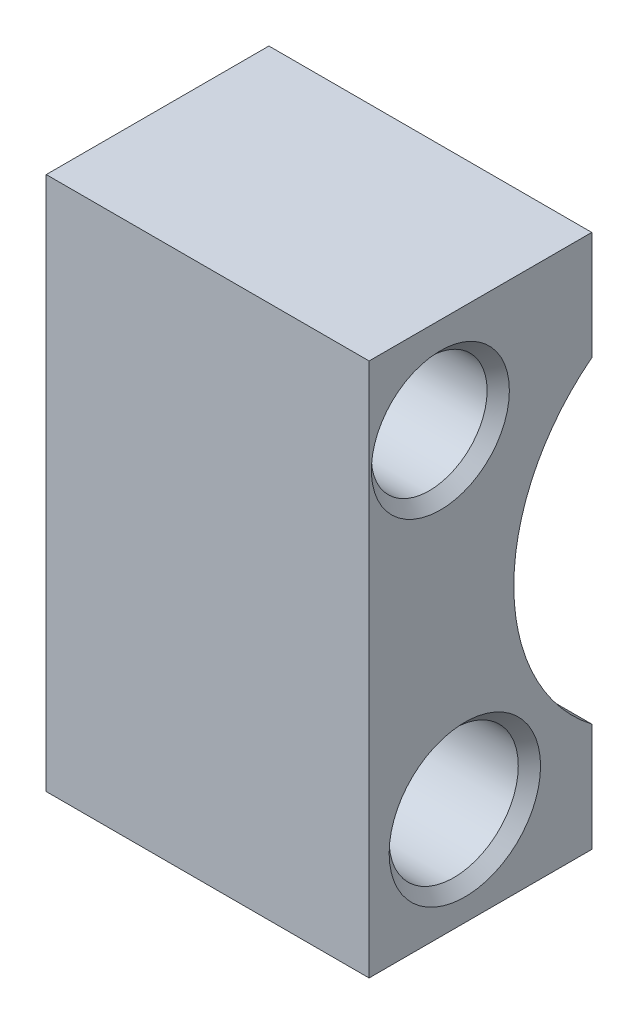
from build123d import *

# Parameters (mm, degrees)
BASE_EXTRUSION_DEPTH    = 7.25
ENL_V_MAT_EXTRU_1_REACH = 26.382
ESQUISSE2_R             = 2.6
ESQUISSE2_R_2           = 1.6
ESQUISSE3_R             = 2.9
ENL_V_MAT_EXTRU_2_DEPTH = 9
CHANFREIN1_SIZE         = 0.5


with BuildPart() as part:
    # Esquisse1 → Base-Extrusion (new, symmetric)
    with BuildSketch(Plane(origin=(0, 0, 0), x_dir=(0, 0, -1), z_dir=(1, 0, 0))):
        with BuildLine():
            Line((-15.5, 12), (-5.5, 12))
            Line((-5.5, 12), (-5.5, 7.123903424))
            ThreePointArc((-5.5, 7.123903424), (-9, 0), (-5.5, -7.123903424))
            Line((-5.5, -7.123903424), (-5.5, -12))
            Line((-5.5, -12), (-15.5, -12))
            Line((-15.5, -12), (-15.5, 12))
        make_face()
    extrude(amount=BASE_EXTRUSION_DEPTH, both=True)

    # Esquisse2 → Enl_v. mat.-Extru.1 (cut, up to next)
    with BuildSketch(Plane(origin=(7.25, 0, 0), x_dir=(0, 0, -1), z_dir=(1, 0, 0)), mode=Mode.PRIVATE) as enl_v_mat_extru_1_sk1:
        with Locations((-12.3, 7.7)):
            Circle(ESQUISSE2_R)
    enl_v_mat_extru_1_tool1 = extrude(enl_v_mat_extru_1_sk1.sketch, amount=-ENL_V_MAT_EXTRU_1_REACH, mode=Mode.PRIVATE) & part.part
    # Esquisse2 → Enl_v. mat.-Extru.1 (cut, up to next)
    with BuildSketch(Plane(origin=(7.25, 0, 0), x_dir=(0, 0, -1), z_dir=(1, 0, 0)), mode=Mode.PRIVATE) as enl_v_mat_extru_1_sk2:
        with Locations((-11.2, -7.6)):
            Circle(ESQUISSE2_R_2)
    enl_v_mat_extru_1_tool2 = extrude(enl_v_mat_extru_1_sk2.sketch, amount=-ENL_V_MAT_EXTRU_1_REACH, mode=Mode.PRIVATE) & part.part
    add(enl_v_mat_extru_1_tool1.solids().sort_by_distance((7.25, 7.7, 12.3))[0], mode=Mode.SUBTRACT)
    add(enl_v_mat_extru_1_tool2.solids().sort_by_distance((7.25, -7.6, 11.2))[0], mode=Mode.SUBTRACT)

    # Esquisse3 → Enl_v. mat.-Extru.2 (cut)
    with BuildSketch(Plane(origin=(7.25, 0, 0), x_dir=(0, 0, -1), z_dir=(1, 0, 0))):
        with Locations((-11.2, -7.6)):
            Circle(ESQUISSE3_R)
    extrude(amount=-ENL_V_MAT_EXTRU_2_DEPTH, mode=Mode.SUBTRACT)

    # Chanfrein1
    chanfrein1_edges = [part.edges().sort_by_distance(p)[0] for p in [
        (7.25, 7.7, 14.9),
        (-7.25, 7.7, 14.9),
        (-7.25, -7.6, 12.8),
        (7.25, -7.6, 14.1),
    ]]
    chamfer(chanfrein1_edges, length=CHANFREIN1_SIZE)


solid = part.part
